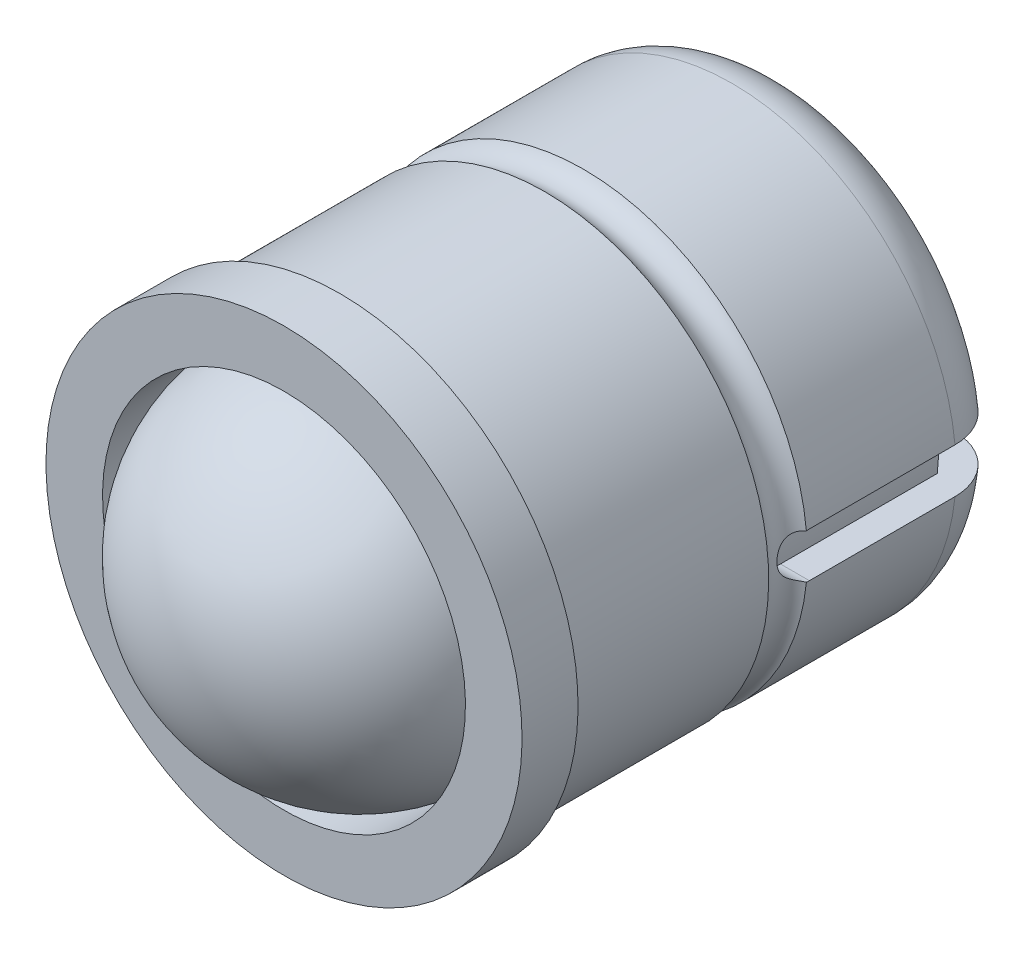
ISO-10303-21;
HEADER;
FILE_DESCRIPTION(('STEP AP214'),'2;1');
FILE_NAME('part.step','',(''),(''),'','','');
FILE_SCHEMA(('AUTOMOTIVE_DESIGN { 1 0 10303 214 1 1 1 1 }'));
ENDSEC;
DATA;
#1=APPLICATION_CONTEXT('core data for automotive mechanical design processes');
#2=APPLICATION_PROTOCOL_DEFINITION('international standard','automotive_design',2000,#1);
#3=PRODUCT_CONTEXT('',#1,'mechanical');
#4=PRODUCT('Part','Part','',(#3));
#5=PRODUCT_RELATED_PRODUCT_CATEGORY('part','',(#4));
#6=PRODUCT_DEFINITION_FORMATION('','',#4);
#7=PRODUCT_DEFINITION_CONTEXT('part definition',#1,'design');
#8=PRODUCT_DEFINITION('design','',#6,#7);
#9=PRODUCT_DEFINITION_SHAPE('','',#8);
#10=(LENGTH_UNIT() NAMED_UNIT(*) SI_UNIT(.MILLI.,.METRE.));
#11=(NAMED_UNIT(*) PLANE_ANGLE_UNIT() SI_UNIT($,.RADIAN.));
#12=(NAMED_UNIT(*) SI_UNIT($,.STERADIAN.) SOLID_ANGLE_UNIT());
#13=UNCERTAINTY_MEASURE_WITH_UNIT(LENGTH_MEASURE(1.E-05),#10,'distance_accuracy_value','');
#14=(GEOMETRIC_REPRESENTATION_CONTEXT(3) GLOBAL_UNCERTAINTY_ASSIGNED_CONTEXT((#13)) GLOBAL_UNIT_ASSIGNED_CONTEXT((#10,
#11,#12)) REPRESENTATION_CONTEXT('',''));
#15=CARTESIAN_POINT('',(0.,0.,0.));
#16=DIRECTION('',(0.,0.,1.));
#17=DIRECTION('',(1.,0.,0.));
#18=AXIS2_PLACEMENT_3D('',#15,#16,#17);
#19=CARTESIAN_POINT('',(4.25,-0.4,-4.4));
#20=DIRECTION('',(0.,1.,0.));
#21=DIRECTION('',(0.,0.,1.));
#22=AXIS2_PLACEMENT_3D('',#19,#20,#21);
#23=PLANE('',#22);
#24=DIRECTION('',(0.,0.,1.));
#25=VECTOR('',#24,1.);
#26=CARTESIAN_POINT('',(-3.46416486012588,-0.4,4.46641435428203));
#27=LINE('',#26,#25);
#28=CARTESIAN_POINT('',(-3.46416486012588,-0.4,-4.4));
#29=VERTEX_POINT('',#28);
#30=CARTESIAN_POINT('',(-3.46416486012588,-0.4,-7.2));
#31=VERTEX_POINT('',#30);
#32=EDGE_CURVE('E382',#29,#31,#27,.F.);
#33=ORIENTED_EDGE('',*,*,#32,.T.);
#34=DIRECTION('',(1.,0.,0.));
#35=VECTOR('',#34,1.);
#36=CARTESIAN_POINT('',(4.25,-0.4,-7.2));
#37=LINE('',#36,#35);
#38=CARTESIAN_POINT('',(3.46416486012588,-0.4,-7.2));
#39=VERTEX_POINT('',#38);
#40=EDGE_CURVE('E35',#31,#39,#37,.T.);
#41=ORIENTED_EDGE('',*,*,#40,.T.);
#42=DIRECTION('',(0.,0.,1.));
#43=VECTOR('',#42,1.);
#44=CARTESIAN_POINT('',(3.46416486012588,-0.4,4.46641435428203));
#45=LINE('',#44,#43);
#46=CARTESIAN_POINT('',(3.46416486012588,-0.4,-4.4));
#47=VERTEX_POINT('',#46);
#48=EDGE_CURVE('E117',#39,#47,#45,.T.);
#49=ORIENTED_EDGE('',*,*,#48,.T.);
#50=DIRECTION('',(1.,0.,0.));
#51=VECTOR('',#50,1.);
#52=CARTESIAN_POINT('',(4.25,-0.4,-4.4));
#53=LINE('',#52,#51);
#54=CARTESIAN_POINT('',(3.97994974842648,-0.4,-4.4));
#55=VERTEX_POINT('',#54);
#56=EDGE_CURVE('E108',#47,#55,#53,.T.);
#57=ORIENTED_EDGE('',*,*,#56,.T.);
#58=DIRECTION('',(0.,0.,-1.));
#59=VECTOR('',#58,1.);
#60=CARTESIAN_POINT('',(3.97994974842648,-0.4,1.));
#61=LINE('',#60,#59);
#62=CARTESIAN_POINT('',(3.97994974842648,-0.4,-7.));
#63=VERTEX_POINT('',#62);
#64=EDGE_CURVE('E216',#63,#55,#61,.F.);
#65=ORIENTED_EDGE('',*,*,#64,.F.);
#66=CARTESIAN_POINT('',(3.97994974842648,-0.4,-7.));
#67=CARTESIAN_POINT('',(3.97994960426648,-0.4,-7.02802424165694));
#68=CARTESIAN_POINT('',(3.97876502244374,-0.4,-7.05603501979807));
#69=CARTESIAN_POINT('',(3.97403961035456,-0.4,-7.11185554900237));
#70=CARTESIAN_POINT('',(3.97049890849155,-0.4,-7.139665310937));
#71=CARTESIAN_POINT('',(3.95637803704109,-0.4,-7.22243882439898));
#72=CARTESIAN_POINT('',(3.94229899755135,-0.4,-7.27684715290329));
#73=CARTESIAN_POINT('',(3.90521055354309,-0.4,-7.38252445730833));
#74=CARTESIAN_POINT('',(3.88219720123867,-0.4,-7.4337920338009));
#75=CARTESIAN_POINT('',(3.82790536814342,-0.4,-7.53174600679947));
#76=CARTESIAN_POINT('',(3.79662806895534,-0.4,-7.57843305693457));
#77=CARTESIAN_POINT('',(3.72664883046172,-0.4,-7.66599798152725));
#78=CARTESIAN_POINT('',(3.6879328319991,-0.4,-7.70686459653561));
#79=CARTESIAN_POINT('',(3.60419227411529,-0.4,-7.78156852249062));
#80=CARTESIAN_POINT('',(3.55916752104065,-0.4,-7.81540561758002));
#81=CARTESIAN_POINT('',(3.48779643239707,-0.4,-7.8602442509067));
#82=CARTESIAN_POINT('',(3.4632832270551,-0.4,-7.8742391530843));
#83=CARTESIAN_POINT('',(3.41319521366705,-0.4,-7.90011539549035));
#84=CARTESIAN_POINT('',(3.38762137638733,-0.4,-7.91199861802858));
#85=CARTESIAN_POINT('',(3.3095395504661,-0.4,-7.94436599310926));
#86=CARTESIAN_POINT('',(3.25562841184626,-0.4,-7.96159469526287));
#87=CARTESIAN_POINT('',(3.16340096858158,-0.4,-7.98279411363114));
#88=CARTESIAN_POINT('',(3.12562576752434,-0.4,-7.98924445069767));
#89=CARTESIAN_POINT('',(3.04964529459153,-0.4,-7.99784581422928));
#90=CARTESIAN_POINT('',(3.01144073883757,-0.4,-8.00000316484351));
#91=CARTESIAN_POINT('',(2.97321374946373,-0.4,-8.));
#92=B_SPLINE_CURVE_WITH_KNOTS('',3,(#66,#67,#68,#69,#70,#71,#72,#73,#74,#75,#76,#77,#78,#79,#80,
#81,#82,#83,#84,#85,#86,#87,#88,#89,#90,#91),.UNSPECIFIED.,.F.,.F.,(4,2,2,2,2,2,2,2,2,2,2,2,4),
(0.,0.0840209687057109,0.168037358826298,0.335772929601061,0.503582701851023,0.671368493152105,
0.839474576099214,1.00758582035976,1.09217941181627,1.17669721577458,1.34558302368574,
1.46032773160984,1.57490327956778),.UNSPECIFIED.);
#93=CARTESIAN_POINT('',(2.97321374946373,-0.4,-8.));
#94=VERTEX_POINT('',#93);
#95=EDGE_CURVE('E115',#63,#94,#92,.T.);
#96=ORIENTED_EDGE('',*,*,#95,.T.);
#97=DIRECTION('',(1.,0.,0.));
#98=VECTOR('',#97,1.);
#99=CARTESIAN_POINT('',(4.25,-0.4,-8.));
#100=LINE('',#99,#98);
#101=CARTESIAN_POINT('',(-2.97321374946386,-0.4,-8.));
#102=VERTEX_POINT('',#101);
#103=EDGE_CURVE('E344',#94,#102,#100,.F.);
#104=ORIENTED_EDGE('',*,*,#103,.T.);
#105=CARTESIAN_POINT('',(-2.97321374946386,-0.4,-8.));
#106=CARTESIAN_POINT('',(-3.03017821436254,-0.4,-8.00004261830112));
#107=CARTESIAN_POINT('',(-3.08712315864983,-0.4,-7.99522038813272));
#108=CARTESIAN_POINT('',(-3.19938395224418,-0.4,-7.97614781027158));
#109=CARTESIAN_POINT('',(-3.25470058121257,-0.4,-7.96190205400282));
#110=CARTESIAN_POINT('',(-3.36220852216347,-0.4,-7.92427110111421));
#111=CARTESIAN_POINT('',(-3.4143977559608,-0.4,-7.90087990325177));
#112=CARTESIAN_POINT('',(-3.48909394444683,-0.4,-7.85948552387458));
#113=CARTESIAN_POINT('',(-3.51339623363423,-0.4,-7.84463493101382));
#114=CARTESIAN_POINT('',(-3.56067934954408,-0.4,-7.81291271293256));
#115=CARTESIAN_POINT('',(-3.58365885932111,-0.4,-7.79603912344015));
#116=CARTESIAN_POINT('',(-3.65005145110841,-0.4,-7.74278349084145));
#117=CARTESIAN_POINT('',(-3.69125163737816,-0.4,-7.70358151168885));
#118=CARTESIAN_POINT('',(-3.76642250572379,-0.4,-7.61877211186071));
#119=CARTESIAN_POINT('',(-3.8003936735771,-0.4,-7.57316512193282));
#120=CARTESIAN_POINT('',(-3.84508938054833,-0.4,-7.50111527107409));
#121=CARTESIAN_POINT('',(-3.85891932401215,-0.4,-7.47655381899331));
#122=CARTESIAN_POINT('',(-3.88444290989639,-0.4,-7.42637498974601));
#123=CARTESIAN_POINT('',(-3.8961384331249,-0.4,-7.40075856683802));
#124=CARTESIAN_POINT('',(-3.92789522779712,-0.4,-7.32256767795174));
#125=CARTESIAN_POINT('',(-3.94466032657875,-0.399999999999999,-7.26859733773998));
#126=CARTESIAN_POINT('',(-3.96445820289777,-0.400000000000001,-7.17856436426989));
#127=CARTESIAN_POINT('',(-3.970263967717,-0.400000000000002,-7.14307653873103));
#128=CARTESIAN_POINT('',(-3.97800789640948,-0.399999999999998,-7.07173317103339));
#129=CARTESIAN_POINT('',(-3.97995162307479,-0.399999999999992,-7.03587823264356));
#130=CARTESIAN_POINT('',(-3.97994974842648,-0.399999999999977,-7.));
#131=B_SPLINE_CURVE_WITH_KNOTS('',3,(#105,#106,#107,#108,#109,#110,#111,#112,#113,#114,#115,
#116,#117,#118,#119,#120,#121,#122,#123,#124,#125,#126,#127,#128,#129,#130),.UNSPECIFIED.,.F.,
.F.,(4,2,2,2,2,2,2,2,2,2,2,2,4),(0.,0.17065519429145,0.341227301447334,0.511911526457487,
0.59726504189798,0.682702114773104,0.852448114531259,1.02218270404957,1.10665536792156,
1.19105323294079,1.35965988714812,1.4673513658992,1.57488761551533),.UNSPECIFIED.);
#132=CARTESIAN_POINT('',(-3.97994974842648,-0.4,-7.));
#133=VERTEX_POINT('',#132);
#134=EDGE_CURVE('E346',#102,#133,#131,.T.);
#135=ORIENTED_EDGE('',*,*,#134,.T.);
#136=DIRECTION('',(0.,0.,-1.));
#137=VECTOR('',#136,1.);
#138=CARTESIAN_POINT('',(-3.97994974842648,-0.4,1.));
#139=LINE('',#138,#137);
#140=CARTESIAN_POINT('',(-3.97994974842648,-0.4,-4.4));
#141=VERTEX_POINT('',#140);
#142=EDGE_CURVE('E211',#141,#133,#139,.T.);
#143=ORIENTED_EDGE('',*,*,#142,.F.);
#144=DIRECTION('',(1.,0.,0.));
#145=VECTOR('',#144,1.);
#146=CARTESIAN_POINT('',(4.25,-0.4,-4.4));
#147=LINE('',#146,#145);
#148=EDGE_CURVE('E350',#141,#29,#147,.T.);
#149=ORIENTED_EDGE('',*,*,#148,.T.);
#150=EDGE_LOOP('',(#33,#41,#49,#57,#65,#96,#104,#135,#143,#149));
#151=FACE_BOUND('',#150,.T.);
#152=ADVANCED_FACE('F14',(#151),#23,.T.);
#153=CARTESIAN_POINT('',(4.25,0.4,-8.));
#154=DIRECTION('',(0.,-1.,0.));
#155=DIRECTION('',(0.,0.,-1.));
#156=AXIS2_PLACEMENT_3D('',#153,#154,#155);
#157=PLANE('',#156);
#158=DIRECTION('',(0.,0.,1.));
#159=VECTOR('',#158,1.);
#160=CARTESIAN_POINT('',(3.46416486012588,0.4,4.46641435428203));
#161=LINE('',#160,#159);
#162=CARTESIAN_POINT('',(3.46416486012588,0.4,-4.4));
#163=VERTEX_POINT('',#162);
#164=CARTESIAN_POINT('',(3.46416486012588,0.4,-7.2));
#165=VERTEX_POINT('',#164);
#166=EDGE_CURVE('E121',#163,#165,#161,.F.);
#167=ORIENTED_EDGE('',*,*,#166,.T.);
#168=DIRECTION('',(1.,0.,0.));
#169=VECTOR('',#168,1.);
#170=CARTESIAN_POINT('',(4.25,0.4,-7.2));
#171=LINE('',#170,#169);
#172=CARTESIAN_POINT('',(-3.46416486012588,0.4,-7.2));
#173=VERTEX_POINT('',#172);
#174=EDGE_CURVE('E222',#165,#173,#171,.F.);
#175=ORIENTED_EDGE('',*,*,#174,.T.);
#176=DIRECTION('',(0.,0.,1.));
#177=VECTOR('',#176,1.);
#178=CARTESIAN_POINT('',(-3.46416486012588,0.4,4.46641435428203));
#179=LINE('',#178,#177);
#180=CARTESIAN_POINT('',(-3.46416486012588,0.4,-4.4));
#181=VERTEX_POINT('',#180);
#182=EDGE_CURVE('E140',#173,#181,#179,.T.);
#183=ORIENTED_EDGE('',*,*,#182,.T.);
#184=DIRECTION('',(1.,0.,0.));
#185=VECTOR('',#184,1.);
#186=CARTESIAN_POINT('',(4.25,0.4,-4.4));
#187=LINE('',#186,#185);
#188=CARTESIAN_POINT('',(-3.97994974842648,0.4,-4.4));
#189=VERTEX_POINT('',#188);
#190=EDGE_CURVE('E219',#181,#189,#187,.F.);
#191=ORIENTED_EDGE('',*,*,#190,.T.);
#192=DIRECTION('',(0.,0.,-1.));
#193=VECTOR('',#192,1.);
#194=CARTESIAN_POINT('',(-3.97994974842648,0.4,1.));
#195=LINE('',#194,#193);
#196=CARTESIAN_POINT('',(-3.97994974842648,0.4,-7.));
#197=VERTEX_POINT('',#196);
#198=EDGE_CURVE('E223',#197,#189,#195,.F.);
#199=ORIENTED_EDGE('',*,*,#198,.F.);
#200=CARTESIAN_POINT('',(-2.97321374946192,0.4,-8.));
#201=CARTESIAN_POINT('',(-3.0301782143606,0.4,-8.00004261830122));
#202=CARTESIAN_POINT('',(-3.0871231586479,0.4,-7.99522038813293));
#203=CARTESIAN_POINT('',(-3.19938395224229,0.4,-7.97614781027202));
#204=CARTESIAN_POINT('',(-3.25470058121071,0.4,-7.96190205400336));
#205=CARTESIAN_POINT('',(-3.36220852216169,0.4,-7.92427110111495));
#206=CARTESIAN_POINT('',(-3.41439775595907,0.4,-7.90087990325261));
#207=CARTESIAN_POINT('',(-3.48909394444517,0.4,-7.85948552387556));
#208=CARTESIAN_POINT('',(-3.51339623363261,0.4,-7.84463493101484));
#209=CARTESIAN_POINT('',(-3.56067934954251,0.4,-7.81291271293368));
#210=CARTESIAN_POINT('',(-3.58365885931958,0.4,-7.79603912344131));
#211=CARTESIAN_POINT('',(-3.65005145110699,0.4,-7.74278349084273));
#212=CARTESIAN_POINT('',(-3.69125163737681,0.4,-7.70358151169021));
#213=CARTESIAN_POINT('',(-3.7664225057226,0.4,-7.61877211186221));
#214=CARTESIAN_POINT('',(-3.800393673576,0.4,-7.57316512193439));
#215=CARTESIAN_POINT('',(-3.84508938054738,0.4,-7.50111527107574));
#216=CARTESIAN_POINT('',(-3.85891932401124,0.4,-7.47655381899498));
#217=CARTESIAN_POINT('',(-3.88444290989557,0.4,-7.42637498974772));
#218=CARTESIAN_POINT('',(-3.89613843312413,0.4,-7.40075856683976));
#219=CARTESIAN_POINT('',(-3.9278952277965,0.4,-7.32256767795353));
#220=CARTESIAN_POINT('',(-3.94466032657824,0.4,-7.2685973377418));
#221=CARTESIAN_POINT('',(-3.9644582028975,0.4,-7.17856436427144));
#222=CARTESIAN_POINT('',(-3.97026396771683,0.400000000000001,-7.14307653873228));
#223=CARTESIAN_POINT('',(-3.97800789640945,0.399999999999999,-7.07173317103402));
#224=CARTESIAN_POINT('',(-3.97995162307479,0.399999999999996,-7.03587823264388));
#225=CARTESIAN_POINT('',(-3.97994974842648,0.39999999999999,-7.));
#226=B_SPLINE_CURVE_WITH_KNOTS('',3,(#200,#201,#202,#203,#204,#205,#206,#207,#208,#209,#210,
#211,#212,#213,#214,#215,#216,#217,#218,#219,#220,#221,#222,#223,#224,#225),.UNSPECIFIED.,.F.,
.F.,(4,2,2,2,2,2,2,2,2,2,2,2,4),(0.,0.170655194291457,0.341227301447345,0.511911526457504,
0.597265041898,0.682702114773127,0.852448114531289,1.0221827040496,1.1066553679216,
1.19105323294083,1.35965988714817,1.46735136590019,1.57488761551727),.UNSPECIFIED.);
#227=CARTESIAN_POINT('',(-2.97321374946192,0.400000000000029,-8.));
#228=VERTEX_POINT('',#227);
#229=EDGE_CURVE('E263',#228,#197,#226,.T.);
#230=ORIENTED_EDGE('',*,*,#229,.F.);
#231=DIRECTION('',(1.,0.,0.));
#232=VECTOR('',#231,1.);
#233=CARTESIAN_POINT('',(4.25,0.4,-8.));
#234=LINE('',#233,#232);
#235=CARTESIAN_POINT('',(2.97321374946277,0.4,-8.));
#236=VERTEX_POINT('',#235);
#237=EDGE_CURVE('E331',#228,#236,#234,.T.);
#238=ORIENTED_EDGE('',*,*,#237,.T.);
#239=CARTESIAN_POINT('',(3.97994974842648,0.4,-7.));
#240=CARTESIAN_POINT('',(3.97994960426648,0.4,-7.02802424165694));
#241=CARTESIAN_POINT('',(3.97876502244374,0.4,-7.05603501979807));
#242=CARTESIAN_POINT('',(3.97403961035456,0.4,-7.11185554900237));
#243=CARTESIAN_POINT('',(3.97049890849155,0.4,-7.139665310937));
#244=CARTESIAN_POINT('',(3.95637803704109,0.4,-7.22243882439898));
#245=CARTESIAN_POINT('',(3.94229899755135,0.4,-7.27684715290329));
#246=CARTESIAN_POINT('',(3.90521055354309,0.4,-7.38252445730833));
#247=CARTESIAN_POINT('',(3.88219720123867,0.4,-7.4337920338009));
#248=CARTESIAN_POINT('',(3.82790536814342,0.4,-7.53174600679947));
#249=CARTESIAN_POINT('',(3.79662806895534,0.4,-7.57843305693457));
#250=CARTESIAN_POINT('',(3.72664883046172,0.4,-7.66599798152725));
#251=CARTESIAN_POINT('',(3.6879328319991,0.4,-7.70686459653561));
#252=CARTESIAN_POINT('',(3.60419227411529,0.4,-7.78156852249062));
#253=CARTESIAN_POINT('',(3.55916752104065,0.4,-7.81540561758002));
#254=CARTESIAN_POINT('',(3.48779643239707,0.4,-7.8602442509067));
#255=CARTESIAN_POINT('',(3.4632832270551,0.4,-7.8742391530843));
#256=CARTESIAN_POINT('',(3.41319521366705,0.4,-7.90011539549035));
#257=CARTESIAN_POINT('',(3.38762137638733,0.4,-7.91199861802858));
#258=CARTESIAN_POINT('',(3.3095395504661,0.4,-7.94436599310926));
#259=CARTESIAN_POINT('',(3.25562841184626,0.4,-7.96159469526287));
#260=CARTESIAN_POINT('',(3.16340096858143,0.4,-7.98279411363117));
#261=CARTESIAN_POINT('',(3.12562576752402,0.4,-7.98924445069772));
#262=CARTESIAN_POINT('',(3.04964529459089,0.4,-7.99784581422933));
#263=CARTESIAN_POINT('',(3.01144073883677,0.4,-8.00000316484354));
#264=CARTESIAN_POINT('',(2.97321374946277,0.4,-8.));
#265=B_SPLINE_CURVE_WITH_KNOTS('',3,(#239,#240,#241,#242,#243,#244,#245,#246,#247,#248,#249,
#250,#251,#252,#253,#254,#255,#256,#257,#258,#259,#260,#261,#262,#263,#264),.UNSPECIFIED.,.F.,
.F.,(4,2,2,2,2,2,2,2,2,2,2,2,4),(0.,0.0840209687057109,0.168037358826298,0.335772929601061,
0.503582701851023,0.671368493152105,0.839474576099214,1.00758582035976,1.09217941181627,
1.17669721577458,1.34558302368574,1.46032773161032,1.57490327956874),.UNSPECIFIED.);
#266=CARTESIAN_POINT('',(3.97994974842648,0.4,-7.));
#267=VERTEX_POINT('',#266);
#268=EDGE_CURVE('E221',#267,#236,#265,.T.);
#269=ORIENTED_EDGE('',*,*,#268,.F.);
#270=DIRECTION('',(0.,0.,-1.));
#271=VECTOR('',#270,1.);
#272=CARTESIAN_POINT('',(3.97994974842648,0.4,1.));
#273=LINE('',#272,#271);
#274=CARTESIAN_POINT('',(3.97994974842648,0.4,-4.4));
#275=VERTEX_POINT('',#274);
#276=EDGE_CURVE('E227',#275,#267,#273,.T.);
#277=ORIENTED_EDGE('',*,*,#276,.F.);
#278=DIRECTION('',(1.,0.,0.));
#279=VECTOR('',#278,1.);
#280=CARTESIAN_POINT('',(4.25,0.4,-4.4));
#281=LINE('',#280,#279);
#282=EDGE_CURVE('E334',#275,#163,#281,.F.);
#283=ORIENTED_EDGE('',*,*,#282,.T.);
#284=EDGE_LOOP('',(#167,#175,#183,#191,#199,#230,#238,#269,#277,#283));
#285=FACE_BOUND('',#284,.T.);
#286=ADVANCED_FACE('F201',(#285),#157,.T.);
#287=CARTESIAN_POINT('',(4.25,0.,-4.4));
#288=DIRECTION('',(1.,0.,0.));
#289=DIRECTION('',(0.,1.,0.));
#290=AXIS2_PLACEMENT_3D('',#287,#288,#289);
#291=CYLINDRICAL_SURFACE('',#290,0.4);
#292=CARTESIAN_POINT('',(-3.46416486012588,-0.4,-4.4));
#293=CARTESIAN_POINT('',(-3.46415641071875,-0.400019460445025,-4.37757535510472));
#294=CARTESIAN_POINT('',(-3.46438237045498,-0.398115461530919,-4.35515809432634));
#295=CARTESIAN_POINT('',(-3.46524034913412,-0.390606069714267,-4.31098244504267));
#296=CARTESIAN_POINT('',(-3.46587195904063,-0.385004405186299,-4.28922341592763));
#297=CARTESIAN_POINT('',(-3.46747899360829,-0.370242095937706,-4.24695330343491));
#298=CARTESIAN_POINT('',(-3.46845453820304,-0.361080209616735,-4.22644265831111));
#299=CARTESIAN_POINT('',(-3.4706365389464,-0.339467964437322,-4.18725143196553));
#300=CARTESIAN_POINT('',(-3.4718429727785,-0.327017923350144,-4.16857067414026));
#301=CARTESIAN_POINT('',(-3.47435775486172,-0.299119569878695,-4.13348168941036));
#302=CARTESIAN_POINT('',(-3.47566650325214,-0.283659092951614,-4.11708316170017));
#303=CARTESIAN_POINT('',(-3.47823481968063,-0.250203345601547,-4.08710571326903));
#304=CARTESIAN_POINT('',(-3.47949438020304,-0.232207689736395,-4.07352722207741));
#305=CARTESIAN_POINT('',(-3.48182639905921,-0.194132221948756,-4.04954273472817));
#306=CARTESIAN_POINT('',(-3.48289833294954,-0.174046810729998,-4.0391455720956));
#307=CARTESIAN_POINT('',(-3.48472980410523,-0.132401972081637,-4.02187598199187));
#308=CARTESIAN_POINT('',(-3.48548936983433,-0.110842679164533,-4.0150032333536));
#309=CARTESIAN_POINT('',(-3.48660775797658,-0.0669616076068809,-4.00500596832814));
#310=CARTESIAN_POINT('',(-3.48696832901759,-0.0446436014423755,-4.00186509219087));
#311=CARTESIAN_POINT('',(-3.48725406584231,0.000206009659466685,-3.99937004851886));
#312=CARTESIAN_POINT('',(-3.4871792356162,0.0227376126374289,-4.00001584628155));
#313=CARTESIAN_POINT('',(-3.48660400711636,0.0672624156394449,-4.00506277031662));
#314=CARTESIAN_POINT('',(-3.48610561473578,0.0892576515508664,-4.00944619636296));
#315=CARTESIAN_POINT('',(-3.48474154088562,0.13219809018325,-4.02181629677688));
#316=CARTESIAN_POINT('',(-3.48387585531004,0.153143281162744,-4.02980301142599));
#317=CARTESIAN_POINT('',(-3.4818710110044,0.193444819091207,-4.0491722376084));
#318=CARTESIAN_POINT('',(-3.48073122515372,0.212797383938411,-4.06056255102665));
#319=CARTESIAN_POINT('',(-3.47830594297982,0.249322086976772,-4.08640942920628));
#320=CARTESIAN_POINT('',(-3.47702044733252,0.266494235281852,-4.100865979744));
#321=CARTESIAN_POINT('',(-3.4744391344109,0.298273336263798,-4.13253221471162));
#322=CARTESIAN_POINT('',(-3.47314329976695,0.312865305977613,-4.14975693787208));
#323=CARTESIAN_POINT('',(-3.47069424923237,0.338957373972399,-4.18642500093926));
#324=CARTESIAN_POINT('',(-3.46954107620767,0.350456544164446,-4.20586900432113));
#325=CARTESIAN_POINT('',(-3.46750730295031,0.370038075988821,-4.24644219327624));
#326=CARTESIAN_POINT('',(-3.46662695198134,0.378117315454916,-4.2675728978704));
#327=CARTESIAN_POINT('',(-3.46524413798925,0.39059323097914,-4.31087778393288));
#328=CARTESIAN_POINT('',(-3.4647411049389,0.394995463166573,-4.33305033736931));
#329=CARTESIAN_POINT('',(-3.46426012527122,0.399171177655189,-4.37022739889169));
#330=CARTESIAN_POINT('',(-3.46416206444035,0.400007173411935,-4.3851172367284));
#331=CARTESIAN_POINT('',(-3.46416486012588,0.4,-4.4));
#332=B_SPLINE_CURVE_WITH_KNOTS('',3,(#292,#293,#294,#295,#296,#297,#298,#299,#300,#301,#302,
#303,#304,#305,#306,#307,#308,#309,#310,#311,#312,#313,#314,#315,#316,#317,#318,#319,#320,#321,
#322,#323,#324,#325,#326,#327,#328,#329,#330,#331),.UNSPECIFIED.,.F.,.F.,(4,2,2,2,2,2,2,2,2,2,2,
2,2,2,2,2,2,2,2,4),(0.,0.0671812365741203,0.134294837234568,0.201431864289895,0.268562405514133,
0.335970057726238,0.403387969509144,0.47099141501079,0.538588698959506,0.60588854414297,
0.673187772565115,0.740170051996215,0.807153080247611,0.874290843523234,0.941428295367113,
1.00894364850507,1.07647923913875,1.144076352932,1.21157113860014,1.25621487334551),.UNSPECIFIED.);
#333=EDGE_CURVE('E120',#29,#181,#332,.T.);
#334=ORIENTED_EDGE('',*,*,#333,.F.);
#335=ORIENTED_EDGE('',*,*,#148,.F.);
#336=CARTESIAN_POINT('',(-3.98031052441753,-0.396393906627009,-4.34641016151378));
#337=CARTESIAN_POINT('',(-3.98019054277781,-0.397595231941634,-4.35530100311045));
#338=CARTESIAN_POINT('',(-3.98010048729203,-0.398496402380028,-4.36421224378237));
#339=CARTESIAN_POINT('',(-3.97998022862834,-0.39969843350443,-4.38207552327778));
#340=CARTESIAN_POINT('',(-3.97995002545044,-0.399999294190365,-4.39102756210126));
#341=CARTESIAN_POINT('',(-3.97994974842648,-0.4,-4.4));
#342=B_SPLINE_CURVE_WITH_KNOTS('',3,(#336,#337,#338,#339,#340,#341),.UNSPECIFIED.,.F.,.F.,(4,2,
4),(0.,0.0268714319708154,0.0537428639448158),.UNSPECIFIED.);
#343=CARTESIAN_POINT('',(-3.98031052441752,-0.396393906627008,-4.34641016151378));
#344=VERTEX_POINT('',#343);
#345=EDGE_CURVE('E215',#344,#141,#342,.T.);
#346=ORIENTED_EDGE('',*,*,#345,.F.);
#347=CARTESIAN_POINT('',(-3.98031052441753,-0.396393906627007,-4.34641016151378));
#348=CARTESIAN_POINT('',(-3.96490408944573,-0.395185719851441,-4.3375196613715));
#349=CARTESIAN_POINT('',(-3.95012555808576,-0.39353641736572,-4.32753058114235));
#350=CARTESIAN_POINT('',(-3.92216379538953,-0.388883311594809,-4.3056779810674));
#351=CARTESIAN_POINT('',(-3.90898798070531,-0.385873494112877,-4.29380629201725));
#352=CARTESIAN_POINT('',(-3.88465198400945,-0.378008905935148,-4.26853077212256));
#353=CARTESIAN_POINT('',(-3.87350278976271,-0.373144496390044,-4.25511919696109));
#354=CARTESIAN_POINT('',(-3.85367669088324,-0.361218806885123,-4.2275315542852));
#355=CARTESIAN_POINT('',(-3.84499198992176,-0.354164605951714,-4.21335807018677));
#356=CARTESIAN_POINT('',(-3.83075685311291,-0.338408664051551,-4.18621208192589));
#357=CARTESIAN_POINT('',(-3.8250073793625,-0.329890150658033,-4.17323667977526));
#358=CARTESIAN_POINT('',(-3.81546022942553,-0.310983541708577,-4.14793045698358));
#359=CARTESIAN_POINT('',(-3.81166497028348,-0.300593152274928,-4.13560045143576));
#360=CARTESIAN_POINT('',(-3.80566595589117,-0.278067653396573,-4.11199417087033));
#361=CARTESIAN_POINT('',(-3.80347780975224,-0.265916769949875,-4.10072913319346));
#362=CARTESIAN_POINT('',(-3.80031289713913,-0.240196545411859,-4.07971512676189));
#363=CARTESIAN_POINT('',(-3.79933871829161,-0.226624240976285,-4.06996943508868));
#364=CARTESIAN_POINT('',(-3.79807836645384,-0.196006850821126,-4.05077324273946));
#365=CARTESIAN_POINT('',(-3.79793247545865,-0.178758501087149,-4.04163760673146));
#366=CARTESIAN_POINT('',(-3.79811285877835,-0.143144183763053,-4.02598362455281));
#367=CARTESIAN_POINT('',(-3.79843868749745,-0.12477928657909,-4.01946281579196));
#368=CARTESIAN_POINT('',(-3.79916017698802,-0.084742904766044,-4.00845733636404));
#369=CARTESIAN_POINT('',(-3.79955931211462,-0.0629610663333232,-4.00436943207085));
#370=CARTESIAN_POINT('',(-3.80000959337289,-0.0190204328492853,-3.99984225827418));
#371=CARTESIAN_POINT('',(-3.80006074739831,0.00313835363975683,-3.99940290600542));
#372=CARTESIAN_POINT('',(-3.79977178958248,0.047557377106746,-4.00220492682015));
#373=CARTESIAN_POINT('',(-3.79942574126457,0.0698140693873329,-4.00550213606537));
#374=CARTESIAN_POINT('',(-3.79864688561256,0.113475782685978,-4.01577786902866));
#375=CARTESIAN_POINT('',(-3.79821401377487,0.134880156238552,-4.02275913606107));
#376=CARTESIAN_POINT('',(-3.79789928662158,0.176314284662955,-4.0402483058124));
#377=CARTESIAN_POINT('',(-3.79801980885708,0.196337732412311,-4.05077124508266));
#378=CARTESIAN_POINT('',(-3.79973694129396,0.234274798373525,-4.07500857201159));
#379=CARTESIAN_POINT('',(-3.80133126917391,0.252191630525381,-4.08871800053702));
#380=CARTESIAN_POINT('',(-3.80638831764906,0.281341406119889,-4.11515285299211));
#381=CARTESIAN_POINT('',(-3.8093193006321,0.293152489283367,-4.127342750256));
#382=CARTESIAN_POINT('',(-3.81711601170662,0.314873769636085,-4.15274949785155));
#383=CARTESIAN_POINT('',(-3.8219794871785,0.324786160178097,-4.16596513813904));
#384=CARTESIAN_POINT('',(-3.83396747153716,0.342558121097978,-4.19284146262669));
#385=CARTESIAN_POINT('',(-3.84110092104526,0.35040934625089,-4.20650371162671));
#386=CARTESIAN_POINT('',(-3.85767793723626,0.364003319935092,-4.23347609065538));
#387=CARTESIAN_POINT('',(-3.86712234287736,0.369745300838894,-4.24678609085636));
#388=CARTESIAN_POINT('',(-3.88748236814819,0.379048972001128,-4.27159759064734));
#389=CARTESIAN_POINT('',(-3.89827496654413,0.382721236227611,-4.2831597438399));
#390=CARTESIAN_POINT('',(-3.92143987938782,0.38870994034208,-4.30495835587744));
#391=CARTESIAN_POINT('',(-3.93381199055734,0.391026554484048,-4.31519498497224));
#392=CARTESIAN_POINT('',(-3.95757756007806,0.394335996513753,-4.33246065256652));
#393=CARTESIAN_POINT('',(-3.96876891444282,0.395488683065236,-4.33973811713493));
#394=CARTESIAN_POINT('',(-3.98031052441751,0.396393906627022,-4.34641016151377));
#395=B_SPLINE_CURVE_WITH_KNOTS('',3,(#347,#348,#349,#350,#351,#352,#353,#354,#355,#356,#357,
#358,#359,#360,#361,#362,#363,#364,#365,#366,#367,#368,#369,#370,#371,#372,#373,#374,#375,#376,
#377,#378,#379,#380,#381,#382,#383,#384,#385,#386,#387,#388,#389,#390,#391,#392,#393,#394),
.UNSPECIFIED.,.F.,.F.,(4,2,2,2,2,2,2,2,2,2,2,2,2,2,2,2,2,2,2,2,2,2,2,4),(0.,0.0534942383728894,
0.107227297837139,0.161243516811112,0.215086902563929,0.264501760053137,0.3139775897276,
0.36392781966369,0.413984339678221,0.47231203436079,0.530584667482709,0.596770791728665,
0.662955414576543,0.730142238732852,0.797379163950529,0.864905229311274,0.932326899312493,
0.983785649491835,1.03518459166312,1.08678853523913,1.13841124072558,1.18692176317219,
1.23542604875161,1.27552257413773),.UNSPECIFIED.);
#396=CARTESIAN_POINT('',(-3.98031052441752,0.396393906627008,-4.34641016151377));
#397=VERTEX_POINT('',#396);
#398=EDGE_CURVE('E218',#344,#397,#395,.T.);
#399=ORIENTED_EDGE('',*,*,#398,.T.);
#400=CARTESIAN_POINT('',(-3.97994974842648,0.4,-4.4));
#401=CARTESIAN_POINT('',(-3.97995002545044,0.399999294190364,-4.39102756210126));
#402=CARTESIAN_POINT('',(-3.97998022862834,0.399698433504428,-4.38207552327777));
#403=CARTESIAN_POINT('',(-3.98010048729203,0.398496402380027,-4.36421224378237));
#404=CARTESIAN_POINT('',(-3.98019054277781,0.397595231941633,-4.35530100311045));
#405=CARTESIAN_POINT('',(-3.98031052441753,0.39639390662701,-4.34641016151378));
#406=B_SPLINE_CURVE_WITH_KNOTS('',3,(#400,#401,#402,#403,#404,#405),.UNSPECIFIED.,.F.,.F.,(4,2,
4),(0.,0.0268714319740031,0.0537428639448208),.UNSPECIFIED.);
#407=EDGE_CURVE('E226',#189,#397,#406,.T.);
#408=ORIENTED_EDGE('',*,*,#407,.F.);
#409=ORIENTED_EDGE('',*,*,#190,.F.);
#410=EDGE_LOOP('',(#334,#335,#346,#399,#408,#409));
#411=FACE_BOUND('',#410,.T.);
#412=ADVANCED_FACE('F142',(#411),#291,.F.);
#413=CARTESIAN_POINT('',(4.25,0.,-4.4));
#414=DIRECTION('',(1.,0.,0.));
#415=DIRECTION('',(0.,1.,0.));
#416=AXIS2_PLACEMENT_3D('',#413,#414,#415);
#417=CYLINDRICAL_SURFACE('',#416,0.4);
#418=CARTESIAN_POINT('',(3.46416486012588,0.4,-4.4));
#419=CARTESIAN_POINT('',(3.46415641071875,0.400019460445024,-4.37757535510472));
#420=CARTESIAN_POINT('',(3.46438237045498,0.398115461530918,-4.35515809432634));
#421=CARTESIAN_POINT('',(3.46524034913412,0.390606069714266,-4.31098244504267));
#422=CARTESIAN_POINT('',(3.46587195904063,0.385004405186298,-4.28922341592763));
#423=CARTESIAN_POINT('',(3.46747899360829,0.370242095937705,-4.24695330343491));
#424=CARTESIAN_POINT('',(3.46845453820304,0.361080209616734,-4.22644265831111));
#425=CARTESIAN_POINT('',(3.4706365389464,0.339467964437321,-4.18725143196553));
#426=CARTESIAN_POINT('',(3.4718429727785,0.327017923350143,-4.16857067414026));
#427=CARTESIAN_POINT('',(3.47435775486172,0.299119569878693,-4.13348168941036));
#428=CARTESIAN_POINT('',(3.47566650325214,0.283659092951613,-4.11708316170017));
#429=CARTESIAN_POINT('',(3.47823481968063,0.250203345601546,-4.08710571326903));
#430=CARTESIAN_POINT('',(3.47949438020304,0.232207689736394,-4.07352722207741));
#431=CARTESIAN_POINT('',(3.48182639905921,0.194132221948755,-4.04954273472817));
#432=CARTESIAN_POINT('',(3.48289833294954,0.174046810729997,-4.0391455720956));
#433=CARTESIAN_POINT('',(3.48472980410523,0.132401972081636,-4.02187598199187));
#434=CARTESIAN_POINT('',(3.48548936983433,0.110842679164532,-4.0150032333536));
#435=CARTESIAN_POINT('',(3.48660775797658,0.0669616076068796,-4.00500596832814));
#436=CARTESIAN_POINT('',(3.48696832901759,0.0446436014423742,-4.00186509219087));
#437=CARTESIAN_POINT('',(3.48725406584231,-0.000206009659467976,-3.99937004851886));
#438=CARTESIAN_POINT('',(3.4871792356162,-0.0227376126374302,-4.00001584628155));
#439=CARTESIAN_POINT('',(3.48660400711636,-0.067262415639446,-4.00506277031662));
#440=CARTESIAN_POINT('',(3.48610561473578,-0.0892576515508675,-4.00944619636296));
#441=CARTESIAN_POINT('',(3.48474154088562,-0.132198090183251,-4.02181629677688));
#442=CARTESIAN_POINT('',(3.48387585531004,-0.153143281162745,-4.02980301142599));
#443=CARTESIAN_POINT('',(3.4818710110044,-0.193444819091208,-4.0491722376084));
#444=CARTESIAN_POINT('',(3.48073122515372,-0.212797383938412,-4.06056255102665));
#445=CARTESIAN_POINT('',(3.47830594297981,-0.249322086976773,-4.08640942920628));
#446=CARTESIAN_POINT('',(3.47702044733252,-0.266494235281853,-4.100865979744));
#447=CARTESIAN_POINT('',(3.4744391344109,-0.298273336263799,-4.13253221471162));
#448=CARTESIAN_POINT('',(3.47314329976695,-0.312865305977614,-4.14975693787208));
#449=CARTESIAN_POINT('',(3.47069424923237,-0.338957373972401,-4.18642500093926));
#450=CARTESIAN_POINT('',(3.46954107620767,-0.350456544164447,-4.20586900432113));
#451=CARTESIAN_POINT('',(3.46750730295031,-0.370038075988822,-4.24644219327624));
#452=CARTESIAN_POINT('',(3.46662695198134,-0.378117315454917,-4.2675728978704));
#453=CARTESIAN_POINT('',(3.46524413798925,-0.390593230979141,-4.31087778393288));
#454=CARTESIAN_POINT('',(3.4647411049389,-0.394995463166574,-4.33305033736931));
#455=CARTESIAN_POINT('',(3.46426012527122,-0.39917117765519,-4.37022739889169));
#456=CARTESIAN_POINT('',(3.46416206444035,-0.400007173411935,-4.3851172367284));
#457=CARTESIAN_POINT('',(3.46416486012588,-0.4,-4.4));
#458=B_SPLINE_CURVE_WITH_KNOTS('',3,(#418,#419,#420,#421,#422,#423,#424,#425,#426,#427,#428,
#429,#430,#431,#432,#433,#434,#435,#436,#437,#438,#439,#440,#441,#442,#443,#444,#445,#446,#447,
#448,#449,#450,#451,#452,#453,#454,#455,#456,#457),.UNSPECIFIED.,.F.,.F.,(4,2,2,2,2,2,2,2,2,2,2,
2,2,2,2,2,2,2,2,4),(0.,0.0671812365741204,0.134294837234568,0.201431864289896,0.268562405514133,
0.335970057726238,0.403387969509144,0.47099141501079,0.538588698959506,0.60588854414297,
0.673187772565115,0.740170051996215,0.807153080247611,0.874290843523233,0.941428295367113,
1.00894364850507,1.07647923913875,1.144076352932,1.21157113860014,1.25621487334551),.UNSPECIFIED.);
#459=EDGE_CURVE('E9',#163,#47,#458,.T.);
#460=ORIENTED_EDGE('',*,*,#459,.F.);
#461=ORIENTED_EDGE('',*,*,#282,.F.);
#462=CARTESIAN_POINT('',(3.98031052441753,0.396393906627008,-4.34641016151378));
#463=CARTESIAN_POINT('',(3.98019054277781,0.397595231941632,-4.35530100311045));
#464=CARTESIAN_POINT('',(3.98010048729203,0.398496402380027,-4.36421224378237));
#465=CARTESIAN_POINT('',(3.97998022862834,0.399698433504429,-4.38207552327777));
#466=CARTESIAN_POINT('',(3.97995002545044,0.399999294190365,-4.39102756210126));
#467=CARTESIAN_POINT('',(3.97994974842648,0.4,-4.4));
#468=B_SPLINE_CURVE_WITH_KNOTS('',3,(#462,#463,#464,#465,#466,#467),.UNSPECIFIED.,.F.,.F.,(4,2,
4),(0.,0.026871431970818,0.053742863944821),.UNSPECIFIED.);
#469=CARTESIAN_POINT('',(3.98031052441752,0.396393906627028,-4.34641016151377));
#470=VERTEX_POINT('',#469);
#471=EDGE_CURVE('E234',#470,#275,#468,.T.);
#472=ORIENTED_EDGE('',*,*,#471,.F.);
#473=CARTESIAN_POINT('',(3.98031052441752,0.396393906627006,-4.34641016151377));
#474=CARTESIAN_POINT('',(3.96490408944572,0.395185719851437,-4.3375196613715));
#475=CARTESIAN_POINT('',(3.95012555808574,0.393536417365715,-4.32753058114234));
#476=CARTESIAN_POINT('',(3.92216379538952,0.388883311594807,-4.30567798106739));
#477=CARTESIAN_POINT('',(3.9089879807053,0.385873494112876,-4.29380629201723));
#478=CARTESIAN_POINT('',(3.88465198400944,0.378008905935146,-4.26853077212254));
#479=CARTESIAN_POINT('',(3.8735027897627,0.373144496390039,-4.25511919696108));
#480=CARTESIAN_POINT('',(3.85367669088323,0.361218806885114,-4.22753155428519));
#481=CARTESIAN_POINT('',(3.84499198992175,0.354164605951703,-4.21335807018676));
#482=CARTESIAN_POINT('',(3.8307568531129,0.338408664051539,-4.18621208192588));
#483=CARTESIAN_POINT('',(3.8250073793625,0.329890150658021,-4.17323667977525));
#484=CARTESIAN_POINT('',(3.81546022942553,0.310983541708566,-4.14793045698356));
#485=CARTESIAN_POINT('',(3.81166497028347,0.300593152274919,-4.13560045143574));
#486=CARTESIAN_POINT('',(3.80566595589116,0.278067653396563,-4.11199417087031));
#487=CARTESIAN_POINT('',(3.80347780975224,0.265916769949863,-4.10072913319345));
#488=CARTESIAN_POINT('',(3.80031289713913,0.240196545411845,-4.07971512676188));
#489=CARTESIAN_POINT('',(3.79933871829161,0.226624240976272,-4.06996943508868));
#490=CARTESIAN_POINT('',(3.79807836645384,0.196006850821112,-4.05077324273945));
#491=CARTESIAN_POINT('',(3.79793247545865,0.178758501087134,-4.04163760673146));
#492=CARTESIAN_POINT('',(3.79811285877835,0.143144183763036,-4.0259836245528));
#493=CARTESIAN_POINT('',(3.79843868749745,0.124779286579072,-4.01946281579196));
#494=CARTESIAN_POINT('',(3.79916017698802,0.0847429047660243,-4.00845733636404));
#495=CARTESIAN_POINT('',(3.79955931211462,0.0629610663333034,-4.00436943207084));
#496=CARTESIAN_POINT('',(3.80000959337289,0.0190204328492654,-3.99984225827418));
#497=CARTESIAN_POINT('',(3.80006074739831,-0.00313835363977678,-3.99940290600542));
#498=CARTESIAN_POINT('',(3.79977178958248,-0.0475573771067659,-4.00220492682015));
#499=CARTESIAN_POINT('',(3.79942574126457,-0.0698140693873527,-4.00550213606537));
#500=CARTESIAN_POINT('',(3.79864688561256,-0.113475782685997,-4.01577786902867));
#501=CARTESIAN_POINT('',(3.79821401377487,-0.134880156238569,-4.02275913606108));
#502=CARTESIAN_POINT('',(3.79789928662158,-0.176314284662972,-4.04024830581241));
#503=CARTESIAN_POINT('',(3.79801980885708,-0.196337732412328,-4.05077124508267));
#504=CARTESIAN_POINT('',(3.79973694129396,-0.234274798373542,-4.0750085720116));
#505=CARTESIAN_POINT('',(3.80133126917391,-0.252191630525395,-4.08871800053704));
#506=CARTESIAN_POINT('',(3.80638831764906,-0.281341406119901,-4.11515285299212));
#507=CARTESIAN_POINT('',(3.8093193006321,-0.293152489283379,-4.12734275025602));
#508=CARTESIAN_POINT('',(3.81711601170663,-0.314873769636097,-4.15274949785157));
#509=CARTESIAN_POINT('',(3.82197948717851,-0.324786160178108,-4.16596513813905));
#510=CARTESIAN_POINT('',(3.83396747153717,-0.342558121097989,-4.1928414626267));
#511=CARTESIAN_POINT('',(3.84110092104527,-0.350409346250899,-4.20650371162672));
#512=CARTESIAN_POINT('',(3.85767793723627,-0.364003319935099,-4.23347609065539));
#513=CARTESIAN_POINT('',(3.86712234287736,-0.369745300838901,-4.24678609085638));
#514=CARTESIAN_POINT('',(3.8874823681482,-0.379048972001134,-4.27159759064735));
#515=CARTESIAN_POINT('',(3.89827496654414,-0.382721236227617,-4.28315974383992));
#516=CARTESIAN_POINT('',(3.92143987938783,-0.388709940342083,-4.30495835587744));
#517=CARTESIAN_POINT('',(3.93381199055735,-0.391026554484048,-4.31519498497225));
#518=CARTESIAN_POINT('',(3.95757756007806,-0.394335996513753,-4.33246065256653));
#519=CARTESIAN_POINT('',(3.96876891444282,-0.395488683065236,-4.33973811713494));
#520=CARTESIAN_POINT('',(3.98031052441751,-0.396393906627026,-4.34641016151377));
#521=B_SPLINE_CURVE_WITH_KNOTS('',3,(#473,#474,#475,#476,#477,#478,#479,#480,#481,#482,#483,
#484,#485,#486,#487,#488,#489,#490,#491,#492,#493,#494,#495,#496,#497,#498,#499,#500,#501,#502,
#503,#504,#505,#506,#507,#508,#509,#510,#511,#512,#513,#514,#515,#516,#517,#518,#519,#520),
.UNSPECIFIED.,.F.,.F.,(4,2,2,2,2,2,2,2,2,2,2,2,2,2,2,2,2,2,2,2,2,2,2,4),(0.,0.0534942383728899,
0.107227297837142,0.161243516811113,0.21508690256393,0.264501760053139,0.313977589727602,
0.363927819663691,0.413984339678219,0.472312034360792,0.530584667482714,0.596770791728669,
0.662955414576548,0.730142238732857,0.797379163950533,0.864905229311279,0.932326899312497,
0.983785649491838,1.03518459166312,1.08678853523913,1.13841124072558,1.18692176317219,
1.23542604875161,1.27552257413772),.UNSPECIFIED.);
#522=CARTESIAN_POINT('',(3.98031052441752,-0.396393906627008,-4.34641016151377));
#523=VERTEX_POINT('',#522);
#524=EDGE_CURVE('E247',#470,#523,#521,.T.);
#525=ORIENTED_EDGE('',*,*,#524,.T.);
#526=CARTESIAN_POINT('',(3.97994974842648,-0.4,-4.4));
#527=CARTESIAN_POINT('',(3.97995002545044,-0.399999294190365,-4.39102756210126));
#528=CARTESIAN_POINT('',(3.97998022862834,-0.399698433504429,-4.38207552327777));
#529=CARTESIAN_POINT('',(3.98010048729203,-0.398496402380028,-4.36421224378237));
#530=CARTESIAN_POINT('',(3.98019054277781,-0.397595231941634,-4.35530100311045));
#531=CARTESIAN_POINT('',(3.98031052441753,-0.39639390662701,-4.34641016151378));
#532=B_SPLINE_CURVE_WITH_KNOTS('',3,(#526,#527,#528,#529,#530,#531),.UNSPECIFIED.,.F.,.F.,(4,2,
4),(0.,0.026871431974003,0.0537428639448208),.UNSPECIFIED.);
#533=EDGE_CURVE('E112',#55,#523,#532,.T.);
#534=ORIENTED_EDGE('',*,*,#533,.F.);
#535=ORIENTED_EDGE('',*,*,#56,.F.);
#536=EDGE_LOOP('',(#460,#461,#472,#525,#534,#535));
#537=FACE_BOUND('',#536,.T.);
#538=ADVANCED_FACE('F109',(#537),#417,.F.);
#539=CARTESIAN_POINT('',(0.,0.,1.));
#540=DIRECTION('',(0.,0.,-1.));
#541=DIRECTION('',(0.,1.,0.));
#542=AXIS2_PLACEMENT_3D('',#539,#540,#541);
#543=CYLINDRICAL_SURFACE('',#542,3.24);
#544=CARTESIAN_POINT('',(0.,0.,1.));
#545=DIRECTION('',(0.,0.,-1.));
#546=DIRECTION('',(0.,1.,0.));
#547=AXIS2_PLACEMENT_3D('',#544,#545,#546);
#548=CIRCLE('',#547,3.24);
#549=CARTESIAN_POINT('',(0.,3.24,1.));
#550=VERTEX_POINT('',#549);
#551=EDGE_CURVE('E329',#550,#550,#548,.F.);
#552=ORIENTED_EDGE('',*,*,#551,.T.);
#553=EDGE_LOOP('',(#552));
#554=FACE_BOUND('',#553,.T.);
#555=CARTESIAN_POINT('',(0.,0.,-0.0952452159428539));
#556=DIRECTION('',(0.,0.,-1.));
#557=DIRECTION('',(-1.,0.,0.));
#558=AXIS2_PLACEMENT_3D('',#555,#556,#557);
#559=CIRCLE('',#558,3.24);
#560=CARTESIAN_POINT('',(-3.24,0.,-0.0952452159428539));
#561=VERTEX_POINT('',#560);
#562=EDGE_CURVE('E28',#561,#561,#559,.F.);
#563=ORIENTED_EDGE('',*,*,#562,.F.);
#564=EDGE_LOOP('',(#563));
#565=FACE_BOUND('',#564,.T.);
#566=ADVANCED_FACE('F163',(#554,#565),#543,.F.);
#567=CARTESIAN_POINT('',(0.,0.,-8.));
#568=DIRECTION('',(0.,0.,1.));
#569=DIRECTION('',(0.,-1.,0.));
#570=AXIS2_PLACEMENT_3D('',#567,#568,#569);
#571=PLANE('',#570);
#572=CARTESIAN_POINT('',(0.,0.,-8.));
#573=DIRECTION('',(0.,0.,1.));
#574=DIRECTION('',(-0.991071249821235,-0.133333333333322,0.));
#575=AXIS2_PLACEMENT_3D('',#572,#573,#574);
#576=CIRCLE('',#575,3.00000000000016);
#577=EDGE_CURVE('E179',#102,#94,#576,.T.);
#578=ORIENTED_EDGE('',*,*,#577,.F.);
#579=ORIENTED_EDGE('',*,*,#103,.F.);
#580=EDGE_LOOP('',(#578,#579));
#581=FACE_BOUND('',#580,.T.);
#582=ADVANCED_FACE('F158',(#581),#571,.F.);
#583=CARTESIAN_POINT('',(0.,0.,-8.));
#584=DIRECTION('',(0.,0.,1.));
#585=DIRECTION('',(0.,-1.,0.));
#586=AXIS2_PLACEMENT_3D('',#583,#584,#585);
#587=PLANE('',#586);
#588=CARTESIAN_POINT('',(0.,0.,-8.));
#589=DIRECTION('',(0.,0.,1.));
#590=DIRECTION('',(0.991071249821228,0.133333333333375,0.));
#591=AXIS2_PLACEMENT_3D('',#588,#589,#590);
#592=CIRCLE('',#591,2.99999999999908);
#593=EDGE_CURVE('E359',#236,#228,#592,.T.);
#594=ORIENTED_EDGE('',*,*,#593,.F.);
#595=ORIENTED_EDGE('',*,*,#237,.F.);
#596=EDGE_LOOP('',(#594,#595));
#597=FACE_BOUND('',#596,.T.);
#598=ADVANCED_FACE('F162',(#597),#587,.F.);
#599=CARTESIAN_POINT('',(4.25,0.,1.));
#600=DIRECTION('',(0.,0.,-1.));
#601=DIRECTION('',(0.,1.,0.));
#602=AXIS2_PLACEMENT_3D('',#599,#600,#601);
#603=PLANE('',#602);
#604=CARTESIAN_POINT('',(0.,0.,1.));
#605=DIRECTION('',(0.,0.,-1.));
#606=DIRECTION('',(0.,1.,0.));
#607=AXIS2_PLACEMENT_3D('',#604,#605,#606);
#608=CIRCLE('',#607,4.25);
#609=CARTESIAN_POINT('',(0.,4.25,1.));
#610=VERTEX_POINT('',#609);
#611=EDGE_CURVE('E262',#610,#610,#608,.T.);
#612=ORIENTED_EDGE('',*,*,#611,.F.);
#613=EDGE_LOOP('',(#612));
#614=FACE_BOUND('',#613,.T.);
#615=ORIENTED_EDGE('',*,*,#551,.F.);
#616=EDGE_LOOP('',(#615));
#617=FACE_BOUND('',#616,.T.);
#618=ADVANCED_FACE('F369',(#614,#617),#603,.F.);
#619=CARTESIAN_POINT('',(0.,0.,-7.));
#620=DIRECTION('',(0.,0.,1.));
#621=DIRECTION('',(0.,-1.,0.));
#622=AXIS2_PLACEMENT_3D('',#619,#620,#621);
#623=TOROIDAL_SURFACE('',#622,3.,1.);
#624=ORIENTED_EDGE('',*,*,#577,.T.);
#625=ORIENTED_EDGE('',*,*,#95,.F.);
#626=CARTESIAN_POINT('',(0.,0.,-7.));
#627=DIRECTION('',(0.,0.,-1.));
#628=DIRECTION('',(0.,1.,0.));
#629=AXIS2_PLACEMENT_3D('',#626,#627,#628);
#630=CIRCLE('',#629,4.);
#631=EDGE_CURVE('E214',#133,#63,#630,.F.);
#632=ORIENTED_EDGE('',*,*,#631,.F.);
#633=ORIENTED_EDGE('',*,*,#134,.F.);
#634=EDGE_LOOP('',(#624,#625,#632,#633));
#635=FACE_BOUND('',#634,.T.);
#636=ADVANCED_FACE('F199',(#635),#623,.T.);
#637=CARTESIAN_POINT('',(0.,0.,-7.));
#638=DIRECTION('',(0.,0.,1.));
#639=DIRECTION('',(0.,-1.,0.));
#640=AXIS2_PLACEMENT_3D('',#637,#638,#639);
#641=TOROIDAL_SURFACE('',#640,3.,1.);
#642=CARTESIAN_POINT('',(0.,0.,-7.));
#643=DIRECTION('',(0.,0.,-1.));
#644=DIRECTION('',(0.,1.,0.));
#645=AXIS2_PLACEMENT_3D('',#642,#643,#644);
#646=CIRCLE('',#645,4.);
#647=EDGE_CURVE('E209',#267,#197,#646,.F.);
#648=ORIENTED_EDGE('',*,*,#647,.F.);
#649=ORIENTED_EDGE('',*,*,#268,.T.);
#650=ORIENTED_EDGE('',*,*,#593,.T.);
#651=ORIENTED_EDGE('',*,*,#229,.T.);
#652=EDGE_LOOP('',(#648,#649,#650,#651));
#653=FACE_BOUND('',#652,.T.);
#654=ADVANCED_FACE('F187',(#653),#641,.T.);
#655=CARTESIAN_POINT('',(0.,0.,1.));
#656=DIRECTION('',(0.,0.,-1.));
#657=DIRECTION('',(0.,1.,0.));
#658=AXIS2_PLACEMENT_3D('',#655,#656,#657);
#659=CYLINDRICAL_SURFACE('',#658,4.25);
#660=CARTESIAN_POINT('',(0.,0.,0.));
#661=DIRECTION('',(0.,0.,-1.));
#662=DIRECTION('',(0.,1.,0.));
#663=AXIS2_PLACEMENT_3D('',#660,#661,#662);
#664=CIRCLE('',#663,4.25);
#665=CARTESIAN_POINT('',(0.,4.25,0.));
#666=VERTEX_POINT('',#665);
#667=EDGE_CURVE('E259',#666,#666,#664,.F.);
#668=ORIENTED_EDGE('',*,*,#667,.T.);
#669=EDGE_LOOP('',(#668));
#670=FACE_BOUND('',#669,.T.);
#671=ORIENTED_EDGE('',*,*,#611,.T.);
#672=EDGE_LOOP('',(#671));
#673=FACE_BOUND('',#672,.T.);
#674=ADVANCED_FACE('F198',(#670,#673),#659,.T.);
#675=CARTESIAN_POINT('',(0.,0.,1.));
#676=DIRECTION('',(0.,0.,-1.));
#677=DIRECTION('',(0.,1.,0.));
#678=AXIS2_PLACEMENT_3D('',#675,#676,#677);
#679=CYLINDRICAL_SURFACE('',#678,4.);
#680=ORIENTED_EDGE('',*,*,#533,.T.);
#681=CARTESIAN_POINT('',(0.,0.,-4.34641016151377));
#682=DIRECTION('',(0.,0.,1.));
#683=DIRECTION('',(0.,-1.,0.));
#684=AXIS2_PLACEMENT_3D('',#681,#682,#683);
#685=CIRCLE('',#684,4.);
#686=EDGE_CURVE('E230',#523,#344,#685,.F.);
#687=ORIENTED_EDGE('',*,*,#686,.T.);
#688=ORIENTED_EDGE('',*,*,#345,.T.);
#689=ORIENTED_EDGE('',*,*,#142,.T.);
#690=ORIENTED_EDGE('',*,*,#631,.T.);
#691=ORIENTED_EDGE('',*,*,#64,.T.);
#692=EDGE_LOOP('',(#680,#687,#688,#689,#690,#691));
#693=FACE_BOUND('',#692,.T.);
#694=ADVANCED_FACE('F279',(#693),#679,.T.);
#695=CARTESIAN_POINT('',(0.,0.,1.));
#696=DIRECTION('',(0.,0.,-1.));
#697=DIRECTION('',(0.,1.,0.));
#698=AXIS2_PLACEMENT_3D('',#695,#696,#697);
#699=CYLINDRICAL_SURFACE('',#698,4.);
#700=ORIENTED_EDGE('',*,*,#276,.T.);
#701=ORIENTED_EDGE('',*,*,#647,.T.);
#702=ORIENTED_EDGE('',*,*,#198,.T.);
#703=ORIENTED_EDGE('',*,*,#407,.T.);
#704=CARTESIAN_POINT('',(0.,0.,-4.34641016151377));
#705=DIRECTION('',(0.,0.,1.));
#706=DIRECTION('',(0.,-1.,0.));
#707=AXIS2_PLACEMENT_3D('',#704,#705,#706);
#708=CIRCLE('',#707,4.);
#709=EDGE_CURVE('E232',#397,#470,#708,.F.);
#710=ORIENTED_EDGE('',*,*,#709,.T.);
#711=ORIENTED_EDGE('',*,*,#471,.T.);
#712=EDGE_LOOP('',(#700,#701,#702,#703,#710,#711));
#713=FACE_BOUND('',#712,.T.);
#714=ADVANCED_FACE('F276',(#713),#699,.T.);
#715=CARTESIAN_POINT('',(4.,0.,0.));
#716=DIRECTION('',(0.,0.,1.));
#717=DIRECTION('',(0.,-1.,0.));
#718=AXIS2_PLACEMENT_3D('',#715,#716,#717);
#719=PLANE('',#718);
#720=CARTESIAN_POINT('',(0.,0.,0.));
#721=DIRECTION('',(0.,0.,-1.));
#722=DIRECTION('',(0.,1.,0.));
#723=AXIS2_PLACEMENT_3D('',#720,#721,#722);
#724=CIRCLE('',#723,4.);
#725=CARTESIAN_POINT('',(0.,4.,0.));
#726=VERTEX_POINT('',#725);
#727=EDGE_CURVE('E512',#726,#726,#724,.T.);
#728=ORIENTED_EDGE('',*,*,#727,.F.);
#729=EDGE_LOOP('',(#728));
#730=FACE_BOUND('',#729,.T.);
#731=ORIENTED_EDGE('',*,*,#667,.F.);
#732=EDGE_LOOP('',(#731));
#733=FACE_BOUND('',#732,.T.);
#734=ADVANCED_FACE('F243',(#730,#733),#719,.F.);
#735=CARTESIAN_POINT('',(0.,0.,-4.));
#736=DIRECTION('',(0.,0.,1.));
#737=DIRECTION('',(0.,-1.,0.));
#738=AXIS2_PLACEMENT_3D('',#735,#736,#737);
#739=TOROIDAL_SURFACE('',#738,4.2,0.4);
#740=ORIENTED_EDGE('',*,*,#709,.F.);
#741=ORIENTED_EDGE('',*,*,#398,.F.);
#742=ORIENTED_EDGE('',*,*,#686,.F.);
#743=ORIENTED_EDGE('',*,*,#524,.F.);
#744=EDGE_LOOP('',(#740,#741,#742,#743));
#745=FACE_BOUND('',#744,.T.);
#746=CARTESIAN_POINT('',(0.,0.,-3.65358983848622));
#747=DIRECTION('',(0.,0.,-1.));
#748=DIRECTION('',(0.,1.,0.));
#749=AXIS2_PLACEMENT_3D('',#746,#747,#748);
#750=CIRCLE('',#749,4.);
#751=CARTESIAN_POINT('',(0.,4.,-3.65358983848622));
#752=VERTEX_POINT('',#751);
#753=EDGE_CURVE('E520',#752,#752,#750,.F.);
#754=ORIENTED_EDGE('',*,*,#753,.F.);
#755=EDGE_LOOP('',(#754));
#756=FACE_BOUND('',#755,.T.);
#757=ADVANCED_FACE('F239',(#745,#756),#739,.F.);
#758=CARTESIAN_POINT('',(0.,0.,1.));
#759=DIRECTION('',(0.,0.,-1.));
#760=DIRECTION('',(0.,1.,0.));
#761=AXIS2_PLACEMENT_3D('',#758,#759,#760);
#762=CYLINDRICAL_SURFACE('',#761,4.);
#763=ORIENTED_EDGE('',*,*,#753,.T.);
#764=EDGE_LOOP('',(#763));
#765=FACE_BOUND('',#764,.T.);
#766=ORIENTED_EDGE('',*,*,#727,.T.);
#767=EDGE_LOOP('',(#766));
#768=FACE_BOUND('',#767,.T.);
#769=ADVANCED_FACE('F16',(#765,#768),#762,.T.);
#770=CARTESIAN_POINT('',(0.,0.,-0.35));
#771=DIRECTION('',(0.,0.,-1.));
#772=DIRECTION('',(1.,0.,0.));
#773=AXIS2_PLACEMENT_3D('',#770,#771,#772);
#774=SPHERICAL_SURFACE('',#773,3.25);
#775=ORIENTED_EDGE('',*,*,#562,.T.);
#776=EDGE_LOOP('',(#775));
#777=FACE_BOUND('',#776,.T.);
#778=ADVANCED_FACE('F154',(#777),#774,.T.);
#779=CARTESIAN_POINT('',(0.,0.,4.46641435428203));
#780=DIRECTION('',(0.,0.,1.));
#781=DIRECTION('',(1.,0.,0.));
#782=AXIS2_PLACEMENT_3D('',#779,#780,#781);
#783=CYLINDRICAL_SURFACE('',#782,3.48718198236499);
#784=ORIENTED_EDGE('',*,*,#32,.F.);
#785=ORIENTED_EDGE('',*,*,#333,.T.);
#786=ORIENTED_EDGE('',*,*,#182,.F.);
#787=CARTESIAN_POINT('',(0.,0.,-7.2));
#788=DIRECTION('',(0.,0.,1.));
#789=DIRECTION('',(1.,0.,0.));
#790=AXIS2_PLACEMENT_3D('',#787,#788,#789);
#791=CIRCLE('',#790,3.48718198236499);
#792=EDGE_CURVE('E128',#173,#31,#791,.T.);
#793=ORIENTED_EDGE('',*,*,#792,.T.);
#794=EDGE_LOOP('',(#784,#785,#786,#793));
#795=FACE_BOUND('',#794,.T.);
#796=ADVANCED_FACE('F150',(#795),#783,.T.);
#797=CARTESIAN_POINT('',(0.,0.,-7.2));
#798=DIRECTION('',(0.,0.,1.));
#799=DIRECTION('',(1.,0.,0.));
#800=AXIS2_PLACEMENT_3D('',#797,#798,#799);
#801=PLANE('',#800);
#802=ORIENTED_EDGE('',*,*,#40,.F.);
#803=ORIENTED_EDGE('',*,*,#792,.F.);
#804=ORIENTED_EDGE('',*,*,#174,.F.);
#805=EDGE_CURVE('E126',#39,#165,#791,.T.);
#806=ORIENTED_EDGE('',*,*,#805,.F.);
#807=EDGE_LOOP('',(#802,#803,#804,#806));
#808=FACE_BOUND('',#807,.T.);
#809=ADVANCED_FACE('F149',(#808),#801,.F.);
#810=ORIENTED_EDGE('',*,*,#48,.F.);
#811=ORIENTED_EDGE('',*,*,#805,.T.);
#812=ORIENTED_EDGE('',*,*,#166,.F.);
#813=ORIENTED_EDGE('',*,*,#459,.T.);
#814=EDGE_LOOP('',(#810,#811,#812,#813));
#815=FACE_BOUND('',#814,.T.);
#816=ADVANCED_FACE('F124',(#815),#783,.T.);
#817=CLOSED_SHELL('',(#152,#286,#412,#538,#566,#582,#598,#618,#636,#654,#674,#694,#714,#734,
#757,#769,#778,#796,#809,#816));
#818=MANIFOLD_SOLID_BREP('B1',#817);
#819=ADVANCED_BREP_SHAPE_REPRESENTATION('',(#18,#818),#14);
#820=SHAPE_DEFINITION_REPRESENTATION(#9,#819);
ENDSEC;
END-ISO-10303-21;
